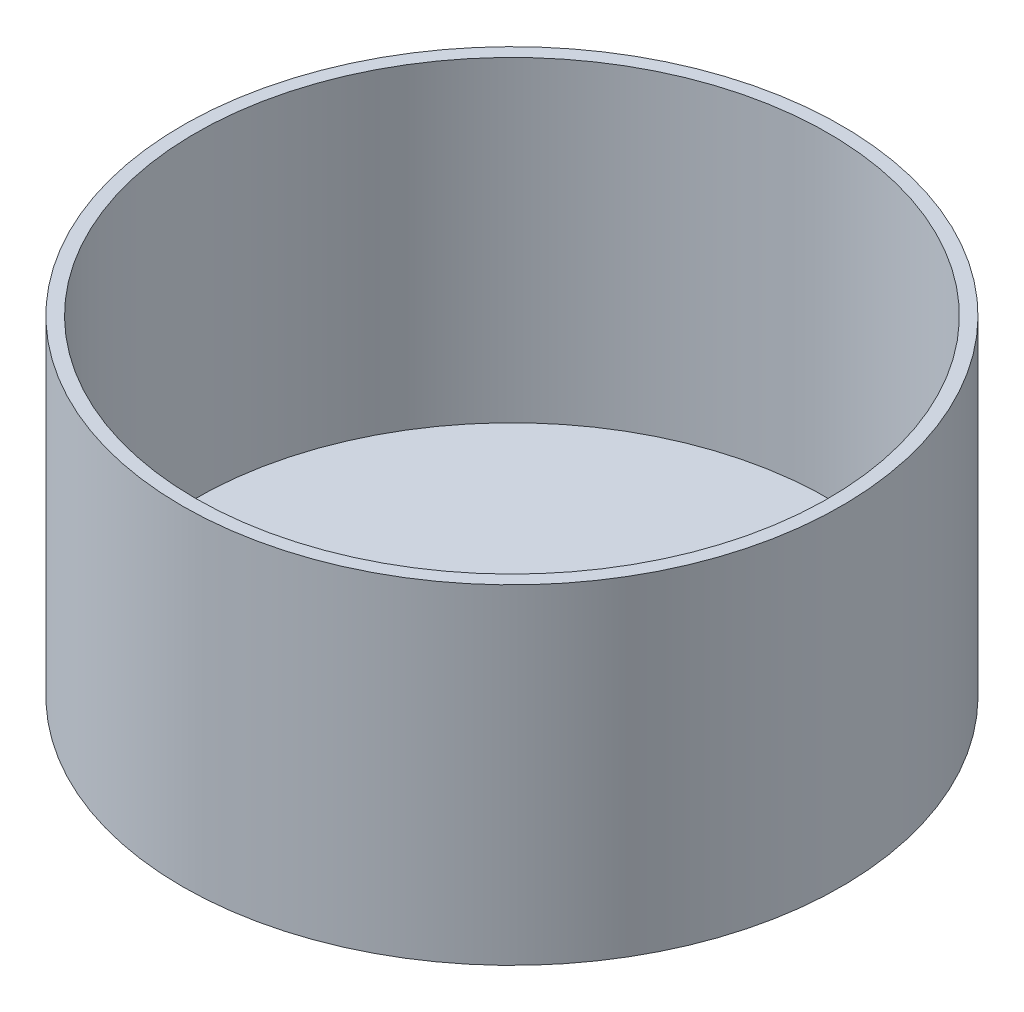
ISO-10303-21;
HEADER;
FILE_DESCRIPTION(('STEP AP214'),'2;1');
FILE_NAME('part.step','',(''),(''),'','','');
FILE_SCHEMA(('AUTOMOTIVE_DESIGN { 1 0 10303 214 1 1 1 1 }'));
ENDSEC;
DATA;
#1=APPLICATION_CONTEXT('core data for automotive mechanical design processes');
#2=APPLICATION_PROTOCOL_DEFINITION('international standard','automotive_design',2000,#1);
#3=PRODUCT_CONTEXT('',#1,'mechanical');
#4=PRODUCT('Part','Part','',(#3));
#5=PRODUCT_RELATED_PRODUCT_CATEGORY('part','',(#4));
#6=PRODUCT_DEFINITION_FORMATION('','',#4);
#7=PRODUCT_DEFINITION_CONTEXT('part definition',#1,'design');
#8=PRODUCT_DEFINITION('design','',#6,#7);
#9=PRODUCT_DEFINITION_SHAPE('','',#8);
#10=(LENGTH_UNIT() NAMED_UNIT(*) SI_UNIT(.MILLI.,.METRE.));
#11=(NAMED_UNIT(*) PLANE_ANGLE_UNIT() SI_UNIT($,.RADIAN.));
#12=(NAMED_UNIT(*) SI_UNIT($,.STERADIAN.) SOLID_ANGLE_UNIT());
#13=UNCERTAINTY_MEASURE_WITH_UNIT(LENGTH_MEASURE(1.E-05),#10,'distance_accuracy_value','');
#14=(GEOMETRIC_REPRESENTATION_CONTEXT(3) GLOBAL_UNCERTAINTY_ASSIGNED_CONTEXT((#13)) GLOBAL_UNIT_ASSIGNED_CONTEXT((#10,
#11,#12)) REPRESENTATION_CONTEXT('',''));
#15=CARTESIAN_POINT('',(0.,0.,0.));
#16=DIRECTION('',(0.,0.,1.));
#17=DIRECTION('',(1.,0.,0.));
#18=AXIS2_PLACEMENT_3D('',#15,#16,#17);
#19=CARTESIAN_POINT('',(0.,63.5,0.));
#20=DIRECTION('',(0.,-1.,0.));
#21=DIRECTION('',(0.,0.,-1.));
#22=AXIS2_PLACEMENT_3D('',#19,#20,#21);
#23=CYLINDRICAL_SURFACE('',#22,63.5);
#24=CARTESIAN_POINT('',(0.,63.5,0.));
#25=DIRECTION('',(0.,1.,0.));
#26=DIRECTION('',(0.,0.,1.));
#27=AXIS2_PLACEMENT_3D('',#24,#25,#26);
#28=CIRCLE('',#27,63.5);
#29=CARTESIAN_POINT('',(0.,63.5,63.5));
#30=VERTEX_POINT('',#29);
#31=EDGE_CURVE('E10',#30,#30,#28,.T.);
#32=ORIENTED_EDGE('',*,*,#31,.F.);
#33=EDGE_LOOP('',(#32));
#34=FACE_BOUND('',#33,.T.);
#35=CARTESIAN_POINT('',(0.,0.,0.));
#36=DIRECTION('',(0.,1.,0.));
#37=DIRECTION('',(0.,0.,1.));
#38=AXIS2_PLACEMENT_3D('',#35,#36,#37);
#39=CIRCLE('',#38,63.5);
#40=CARTESIAN_POINT('',(0.,0.,63.5));
#41=VERTEX_POINT('',#40);
#42=EDGE_CURVE('E34',#41,#41,#39,.T.);
#43=ORIENTED_EDGE('',*,*,#42,.T.);
#44=EDGE_LOOP('',(#43));
#45=FACE_BOUND('',#44,.T.);
#46=ADVANCED_FACE('F31',(#34,#45),#23,.T.);
#47=CARTESIAN_POINT('',(0.,63.5,0.));
#48=DIRECTION('',(0.,1.,0.));
#49=DIRECTION('',(0.,0.,1.));
#50=AXIS2_PLACEMENT_3D('',#47,#48,#49);
#51=PLANE('',#50);
#52=CARTESIAN_POINT('',(0.,63.5,0.));
#53=DIRECTION('',(0.,1.,0.));
#54=DIRECTION('',(0.,0.,1.));
#55=AXIS2_PLACEMENT_3D('',#52,#53,#54);
#56=CIRCLE('',#55,60.96);
#57=CARTESIAN_POINT('',(0.,63.5,60.96));
#58=VERTEX_POINT('',#57);
#59=EDGE_CURVE('E41',#58,#58,#56,.T.);
#60=ORIENTED_EDGE('',*,*,#59,.F.);
#61=EDGE_LOOP('',(#60));
#62=FACE_BOUND('',#61,.T.);
#63=ORIENTED_EDGE('',*,*,#31,.T.);
#64=EDGE_LOOP('',(#63));
#65=FACE_BOUND('',#64,.T.);
#66=ADVANCED_FACE('F61',(#62,#65),#51,.T.);
#67=CARTESIAN_POINT('',(0.,0.,0.));
#68=DIRECTION('',(0.,1.,0.));
#69=DIRECTION('',(0.,0.,1.));
#70=AXIS2_PLACEMENT_3D('',#67,#68,#69);
#71=PLANE('',#70);
#72=ORIENTED_EDGE('',*,*,#42,.F.);
#73=EDGE_LOOP('',(#72));
#74=FACE_BOUND('',#73,.T.);
#75=ADVANCED_FACE('F53',(#74),#71,.F.);
#76=CARTESIAN_POINT('',(0.,63.5,0.));
#77=DIRECTION('',(0.,-1.,0.));
#78=DIRECTION('',(0.,0.,-1.));
#79=AXIS2_PLACEMENT_3D('',#76,#77,#78);
#80=CYLINDRICAL_SURFACE('',#79,60.96);
#81=ORIENTED_EDGE('',*,*,#59,.T.);
#82=EDGE_LOOP('',(#81));
#83=FACE_BOUND('',#82,.T.);
#84=CARTESIAN_POINT('',(0.,2.54,0.));
#85=DIRECTION('',(0.,1.,0.));
#86=DIRECTION('',(0.,0.,1.));
#87=AXIS2_PLACEMENT_3D('',#84,#85,#86);
#88=CIRCLE('',#87,60.96);
#89=CARTESIAN_POINT('',(0.,2.54,60.96));
#90=VERTEX_POINT('',#89);
#91=EDGE_CURVE('E45',#90,#90,#88,.T.);
#92=ORIENTED_EDGE('',*,*,#91,.F.);
#93=EDGE_LOOP('',(#92));
#94=FACE_BOUND('',#93,.T.);
#95=ADVANCED_FACE('F51',(#83,#94),#80,.F.);
#96=CARTESIAN_POINT('',(0.,2.54,0.));
#97=DIRECTION('',(0.,1.,0.));
#98=DIRECTION('',(0.,0.,1.));
#99=AXIS2_PLACEMENT_3D('',#96,#97,#98);
#100=PLANE('',#99);
#101=ORIENTED_EDGE('',*,*,#91,.T.);
#102=EDGE_LOOP('',(#101));
#103=FACE_BOUND('',#102,.T.);
#104=ADVANCED_FACE('F49',(#103),#100,.T.);
#105=CLOSED_SHELL('',(#46,#66,#75,#95,#104));
#106=MANIFOLD_SOLID_BREP('B2',#105);
#107=ADVANCED_BREP_SHAPE_REPRESENTATION('',(#18,#106),#14);
#108=SHAPE_DEFINITION_REPRESENTATION(#9,#107);
ENDSEC;
END-ISO-10303-21;
